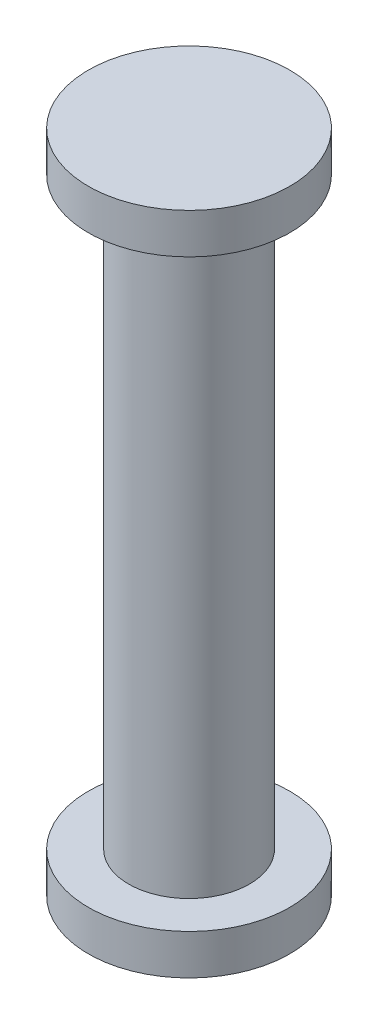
from build123d import *


with BuildPart() as part:
    # Sketch 1 → Revolve 1 (revolve)
    with BuildSketch(Plane.XY, mode=Mode.PRIVATE) as revolve_1_sk:
        Polygon((0, 0), (0, 16.5), (-2.5, 16.5), (-2.5, 15.5), (-1.5, 15.5), (-1.5, 1), (-2.5, 1), (-2.5, 0), align=None)
    revolve(revolve_1_sk.sketch.rotate(Axis((0, 0, 0), (0, 1, 0)), 270), axis=Axis((0, 0, 0), (0, 1, 0)))


solid = part.part
